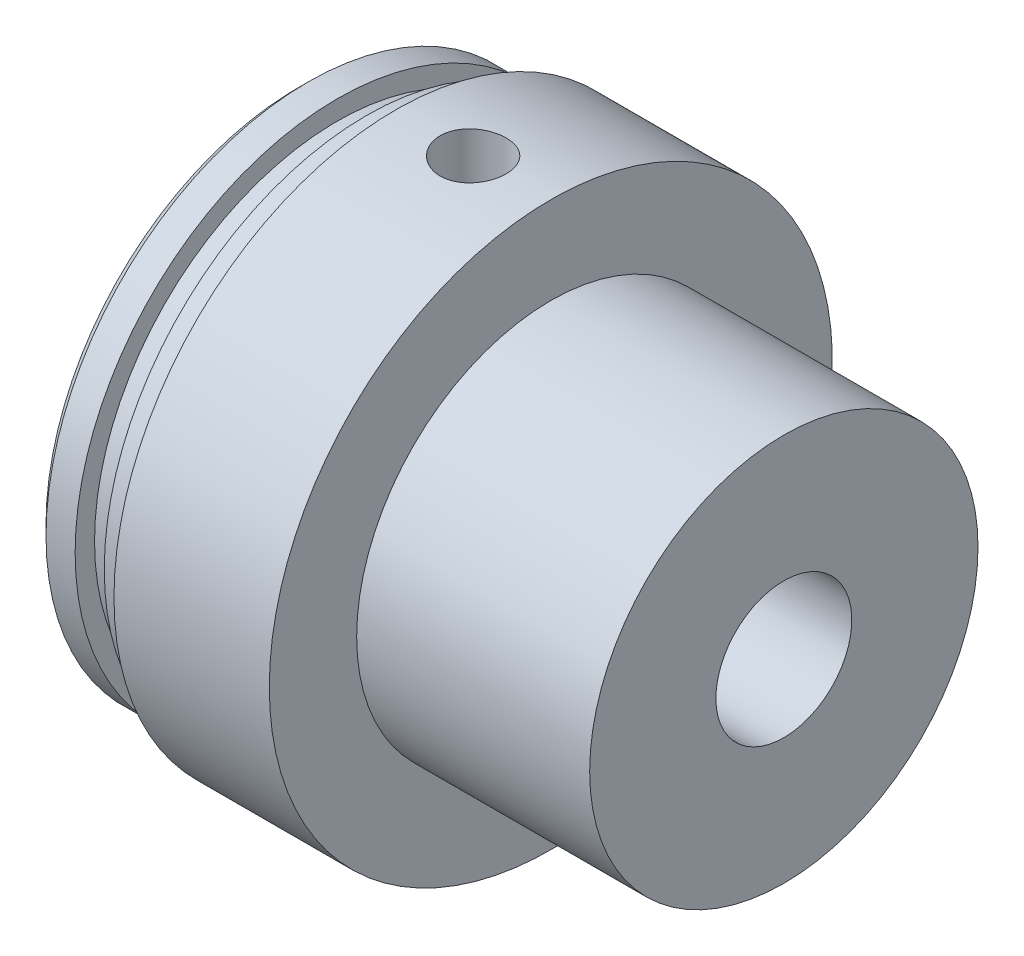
ISO-10303-21;
HEADER;
FILE_DESCRIPTION(('STEP AP214'),'2;1');
FILE_NAME('part.step','',(''),(''),'','','');
FILE_SCHEMA(('AUTOMOTIVE_DESIGN { 1 0 10303 214 1 1 1 1 }'));
ENDSEC;
DATA;
#1=APPLICATION_CONTEXT('core data for automotive mechanical design processes');
#2=APPLICATION_PROTOCOL_DEFINITION('international standard','automotive_design',2000,#1);
#3=PRODUCT_CONTEXT('',#1,'mechanical');
#4=PRODUCT('Part','Part','',(#3));
#5=PRODUCT_RELATED_PRODUCT_CATEGORY('part','',(#4));
#6=PRODUCT_DEFINITION_FORMATION('','',#4);
#7=PRODUCT_DEFINITION_CONTEXT('part definition',#1,'design');
#8=PRODUCT_DEFINITION('design','',#6,#7);
#9=PRODUCT_DEFINITION_SHAPE('','',#8);
#10=(LENGTH_UNIT() NAMED_UNIT(*) SI_UNIT(.MILLI.,.METRE.));
#11=(NAMED_UNIT(*) PLANE_ANGLE_UNIT() SI_UNIT($,.RADIAN.));
#12=(NAMED_UNIT(*) SI_UNIT($,.STERADIAN.) SOLID_ANGLE_UNIT());
#13=UNCERTAINTY_MEASURE_WITH_UNIT(LENGTH_MEASURE(1.E-05),#10,'distance_accuracy_value','');
#14=(GEOMETRIC_REPRESENTATION_CONTEXT(3) GLOBAL_UNCERTAINTY_ASSIGNED_CONTEXT((#13)) GLOBAL_UNIT_ASSIGNED_CONTEXT((#10,
#11,#12)) REPRESENTATION_CONTEXT('',''));
#15=CARTESIAN_POINT('',(0.,0.,0.));
#16=DIRECTION('',(0.,0.,1.));
#17=DIRECTION('',(1.,0.,0.));
#18=AXIS2_PLACEMENT_3D('',#15,#16,#17);
#19=CARTESIAN_POINT('',(-46.0679162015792,0.,0.));
#20=DIRECTION('',(-1.,0.,0.));
#21=DIRECTION('',(0.,0.,1.));
#22=AXIS2_PLACEMENT_3D('',#19,#20,#21);
#23=CYLINDRICAL_SURFACE('',#22,20.);
#24=CARTESIAN_POINT('',(26.,0.,0.));
#25=DIRECTION('',(-1.,0.,0.));
#26=DIRECTION('',(0.,0.,1.));
#27=AXIS2_PLACEMENT_3D('',#24,#25,#26);
#28=CIRCLE('',#27,20.);
#29=CARTESIAN_POINT('',(26.,0.,20.));
#30=VERTEX_POINT('',#29);
#31=EDGE_CURVE('E71',#30,#30,#28,.T.);
#32=CARTESIAN_POINT('',(50.,0.,0.));
#33=DIRECTION('',(-1.,0.,0.));
#34=DIRECTION('',(0.,0.,1.));
#35=AXIS2_PLACEMENT_3D('',#32,#33,#34);
#36=CIRCLE('',#35,20.);
#37=CARTESIAN_POINT('',(50.,0.,20.));
#38=VERTEX_POINT('',#37);
#39=EDGE_CURVE('E101',#38,#38,#36,.T.);
#40=CARTESIAN_POINT('',(26.,0.,20.));
#41=CARTESIAN_POINT('',(26.25,0.,20.));
#42=CARTESIAN_POINT('',(26.5,0.,20.));
#43=CARTESIAN_POINT('',(27.,0.,20.));
#44=CARTESIAN_POINT('',(27.25,0.,20.));
#45=CARTESIAN_POINT('',(27.75,0.,20.));
#46=CARTESIAN_POINT('',(28.,0.,20.));
#47=CARTESIAN_POINT('',(28.5,0.,20.));
#48=CARTESIAN_POINT('',(28.75,0.,20.));
#49=CARTESIAN_POINT('',(29.25,0.,20.));
#50=CARTESIAN_POINT('',(29.5,0.,20.));
#51=CARTESIAN_POINT('',(30.,0.,20.));
#52=CARTESIAN_POINT('',(30.25,0.,20.));
#53=CARTESIAN_POINT('',(30.75,0.,20.));
#54=CARTESIAN_POINT('',(31.,0.,20.));
#55=CARTESIAN_POINT('',(31.5,0.,20.));
#56=CARTESIAN_POINT('',(31.75,0.,20.));
#57=CARTESIAN_POINT('',(32.25,0.,20.));
#58=CARTESIAN_POINT('',(32.5,0.,20.));
#59=CARTESIAN_POINT('',(33.,0.,20.));
#60=CARTESIAN_POINT('',(33.25,0.,20.));
#61=CARTESIAN_POINT('',(33.75,0.,20.));
#62=CARTESIAN_POINT('',(34.,0.,20.));
#63=CARTESIAN_POINT('',(34.5,0.,20.));
#64=CARTESIAN_POINT('',(34.75,0.,20.));
#65=CARTESIAN_POINT('',(35.25,0.,20.));
#66=CARTESIAN_POINT('',(35.5,0.,20.));
#67=CARTESIAN_POINT('',(36.,0.,20.));
#68=CARTESIAN_POINT('',(36.25,0.,20.));
#69=CARTESIAN_POINT('',(36.75,0.,20.));
#70=CARTESIAN_POINT('',(37.,0.,20.));
#71=CARTESIAN_POINT('',(37.5,0.,20.));
#72=CARTESIAN_POINT('',(37.75,0.,20.));
#73=CARTESIAN_POINT('',(38.25,0.,20.));
#74=CARTESIAN_POINT('',(38.5,0.,20.));
#75=CARTESIAN_POINT('',(39.,0.,20.));
#76=CARTESIAN_POINT('',(39.25,0.,20.));
#77=CARTESIAN_POINT('',(39.75,0.,20.));
#78=CARTESIAN_POINT('',(40.,0.,20.));
#79=CARTESIAN_POINT('',(40.5,0.,20.));
#80=CARTESIAN_POINT('',(40.75,0.,20.));
#81=CARTESIAN_POINT('',(41.25,0.,20.));
#82=CARTESIAN_POINT('',(41.5,0.,20.));
#83=CARTESIAN_POINT('',(42.,0.,20.));
#84=CARTESIAN_POINT('',(42.25,0.,20.));
#85=CARTESIAN_POINT('',(42.75,0.,20.));
#86=CARTESIAN_POINT('',(43.,0.,20.));
#87=CARTESIAN_POINT('',(43.5,0.,20.));
#88=CARTESIAN_POINT('',(43.75,0.,20.));
#89=CARTESIAN_POINT('',(44.25,0.,20.));
#90=CARTESIAN_POINT('',(44.5000000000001,0.,20.));
#91=CARTESIAN_POINT('',(45.0000000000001,0.,20.));
#92=CARTESIAN_POINT('',(45.2500000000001,0.,20.));
#93=CARTESIAN_POINT('',(45.7500000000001,0.,20.));
#94=CARTESIAN_POINT('',(46.0000000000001,0.,20.));
#95=CARTESIAN_POINT('',(46.5000000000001,0.,20.));
#96=CARTESIAN_POINT('',(46.7500000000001,0.,20.));
#97=CARTESIAN_POINT('',(47.25,0.,20.));
#98=CARTESIAN_POINT('',(47.5,0.,20.));
#99=CARTESIAN_POINT('',(48.,0.,20.));
#100=CARTESIAN_POINT('',(48.25,0.,20.));
#101=CARTESIAN_POINT('',(48.75,0.,20.));
#102=CARTESIAN_POINT('',(49.,0.,20.));
#103=CARTESIAN_POINT('',(49.5,0.,20.));
#104=CARTESIAN_POINT('',(49.75,0.,20.));
#105=CARTESIAN_POINT('',(50.,0.,20.));
#106=B_SPLINE_CURVE_WITH_KNOTS('',3,(#40,#41,#42,#43,#44,#45,#46,#47,#48,#49,#50,#51,#52,#53,
#54,#55,#56,#57,#58,#59,#60,#61,#62,#63,#64,#65,#66,#67,#68,#69,#70,#71,#72,#73,#74,#75,#76,#77,
#78,#79,#80,#81,#82,#83,#84,#85,#86,#87,#88,#89,#90,#91,#92,#93,#94,#95,#96,#97,#98,#99,#100,
#101,#102,#103,#104,#105),.UNSPECIFIED.,.F.,.F.,(4,2,2,2,2,2,2,2,2,2,2,2,2,2,2,2,2,2,2,2,2,2,2,
2,2,2,2,2,2,2,2,2,4),(0.,0.750000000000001,1.5,2.25,3.,3.75,4.5,5.25,6.00000000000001,
6.75000000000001,7.50000000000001,8.25000000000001,9.00000000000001,9.75000000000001,10.5,11.25,
12.,12.75,13.5,14.25,15.,15.75,16.5,17.25,18.,18.75,19.5,20.25,21.,21.75,22.5,23.25,24.),.UNSPECIFIED.);
#107=EDGE_CURVE('BSEAM36',#30,#38,#106,.T.);
#108=ORIENTED_EDGE('',*,*,#31,.F.);
#109=ORIENTED_EDGE('',*,*,#39,.T.);
#110=ORIENTED_EDGE('',*,*,#107,.T.);
#111=ORIENTED_EDGE('',*,*,#107,.F.);
#112=EDGE_LOOP('',(#108,#110,#109,#111));
#113=FACE_BOUND('',#112,.T.);
#114=ADVANCED_FACE('F36',(#113),#23,.T.);
#115=CARTESIAN_POINT('',(49.9999999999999,20.,0.));
#116=DIRECTION('',(-1.,0.,0.));
#117=DIRECTION('',(0.,0.,1.));
#118=AXIS2_PLACEMENT_3D('',#115,#116,#117);
#119=PLANE('',#118);
#120=ORIENTED_EDGE('',*,*,#39,.F.);
#121=EDGE_LOOP('',(#120));
#122=FACE_BOUND('',#121,.T.);
#123=CARTESIAN_POINT('',(50.,0.,0.));
#124=DIRECTION('',(-1.,0.,0.));
#125=DIRECTION('',(0.,0.,1.));
#126=AXIS2_PLACEMENT_3D('',#123,#124,#125);
#127=CIRCLE('',#126,7.);
#128=CARTESIAN_POINT('',(50.,0.,7.));
#129=VERTEX_POINT('',#128);
#130=EDGE_CURVE('E98',#129,#129,#127,.T.);
#131=ORIENTED_EDGE('',*,*,#130,.T.);
#132=EDGE_LOOP('',(#131));
#133=FACE_BOUND('',#132,.T.);
#134=ADVANCED_FACE('F149',(#122,#133),#119,.F.);
#135=CARTESIAN_POINT('',(-46.0679162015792,0.,0.));
#136=DIRECTION('',(-1.,0.,0.));
#137=DIRECTION('',(0.,0.,1.));
#138=AXIS2_PLACEMENT_3D('',#135,#136,#137);
#139=CYLINDRICAL_SURFACE('',#138,7.);
#140=CARTESIAN_POINT('',(17.9633307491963,6.99973595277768,-0.0607996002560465));
#141=CARTESIAN_POINT('',(17.9598838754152,6.99975371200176,-0.0587550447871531));
#142=CARTESIAN_POINT('',(17.9566066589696,6.99977311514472,-0.0564188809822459));
#143=CARTESIAN_POINT('',(17.9504886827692,6.99981303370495,-0.0512271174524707));
#144=CARTESIAN_POINT('',(17.947648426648,6.99983355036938,-0.0483709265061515));
#145=CARTESIAN_POINT('',(17.9424929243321,6.9998733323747,-0.042222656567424));
#146=CARTESIAN_POINT('',(17.9401771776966,6.99989259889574,-0.0389309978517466));
#147=CARTESIAN_POINT('',(17.9361371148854,6.99992769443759,-0.0320038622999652));
#148=CARTESIAN_POINT('',(17.9344126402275,6.99994352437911,-0.0283684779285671));
#149=CARTESIAN_POINT('',(17.9316175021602,6.99996982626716,-0.0208877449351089));
#150=CARTESIAN_POINT('',(17.9305417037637,6.99998034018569,-0.0170443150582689));
#151=CARTESIAN_POINT('',(17.9290546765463,6.99999500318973,-0.00923086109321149));
#152=CARTESIAN_POINT('',(17.9286434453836,6.99999915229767,-0.00526083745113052));
#153=CARTESIAN_POINT('',(17.9284983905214,7.00000060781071,0.00266903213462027));
#154=CARTESIAN_POINT('',(17.9287607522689,6.99999795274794,0.00662880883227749));
#155=CARTESIAN_POINT('',(17.9299469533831,6.9999861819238,0.0144479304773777));
#156=CARTESIAN_POINT('',(17.930870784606,6.99997706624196,0.0183072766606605));
#157=CARTESIAN_POINT('',(17.9333517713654,6.99995340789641,0.0258143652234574));
#158=CARTESIAN_POINT('',(17.9349085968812,6.99993886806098,0.0294622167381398));
#159=CARTESIAN_POINT('',(17.9386097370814,6.999905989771,0.0364464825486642));
#160=CARTESIAN_POINT('',(17.9407540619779,6.99988765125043,0.039782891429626));
#161=CARTESIAN_POINT('',(17.9455795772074,6.99984912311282,0.0460672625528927));
#162=CARTESIAN_POINT('',(17.9482632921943,6.99982892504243,0.0490132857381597));
#163=CARTESIAN_POINT('',(17.9540837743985,6.99978900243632,0.0544172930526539));
#164=CARTESIAN_POINT('',(17.9572205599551,6.99976927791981,0.0568752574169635));
#165=CARTESIAN_POINT('',(17.9638845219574,6.99973233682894,0.0612540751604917));
#166=CARTESIAN_POINT('',(17.9674145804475,6.99971514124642,0.0631705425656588));
#167=CARTESIAN_POINT('',(17.9747446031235,6.99968536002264,0.0663887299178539));
#168=CARTESIAN_POINT('',(17.9785445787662,6.9996727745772,0.0676904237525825));
#169=CARTESIAN_POINT('',(17.9863371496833,6.99965353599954,0.0696516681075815));
#170=CARTESIAN_POINT('',(17.9903309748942,6.9996469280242,0.0703063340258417));
#171=CARTESIAN_POINT('',(17.9983719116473,6.99964054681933,0.0709388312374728));
#172=CARTESIAN_POINT('',(18.002419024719,6.99964077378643,0.0709166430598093));
#173=CARTESIAN_POINT('',(18.0104685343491,6.99964805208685,0.070194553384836));
#174=CARTESIAN_POINT('',(18.0144706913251,6.99965513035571,0.0694919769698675));
#175=CARTESIAN_POINT('',(18.0223000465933,6.99967535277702,0.0674241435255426));
#176=CARTESIAN_POINT('',(18.0261272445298,6.9996884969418,0.0660588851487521));
#177=CARTESIAN_POINT('',(18.033492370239,6.99971934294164,0.0627049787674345));
#178=CARTESIAN_POINT('',(18.0370306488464,6.9997370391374,0.0607171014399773));
#179=CARTESIAN_POINT('',(18.0437206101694,6.99977498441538,0.0561721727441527));
#180=CARTESIAN_POINT('',(18.0468723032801,6.99979523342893,0.0536151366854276));
#181=CARTESIAN_POINT('',(18.0526790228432,6.99983584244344,0.0480201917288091));
#182=CARTESIAN_POINT('',(18.0553368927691,6.99985620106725,0.0449852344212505));
#183=CARTESIAN_POINT('',(18.0601003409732,6.99989482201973,0.0385090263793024));
#184=CARTESIAN_POINT('',(18.0622059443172,6.99991308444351,0.0350677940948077));
#185=CARTESIAN_POINT('',(18.0657868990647,6.99994527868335,0.0279069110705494));
#186=CARTESIAN_POINT('',(18.0672672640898,6.99995924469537,0.0241897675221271));
#187=CARTESIAN_POINT('',(18.0695781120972,6.99998145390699,0.01655867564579));
#188=CARTESIAN_POINT('',(18.0704086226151,6.99998969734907,0.0126447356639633));
#189=CARTESIAN_POINT('',(18.0713913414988,6.99999948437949,0.00475963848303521));
#190=CARTESIAN_POINT('',(18.071548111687,7.00000107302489,0.000789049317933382));
#191=CARTESIAN_POINT('',(18.0711911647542,6.99999749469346,-0.00712181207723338));
#192=CARTESIAN_POINT('',(18.070677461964,6.99999232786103,-0.011062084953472));
#193=CARTESIAN_POINT('',(18.0689968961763,6.99997584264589,-0.0187913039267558));
#194=CARTESIAN_POINT('',(18.0678315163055,6.99996453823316,-0.0225805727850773));
#195=CARTESIAN_POINT('',(18.0648831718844,6.99993705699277,-0.0299106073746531));
#196=CARTESIAN_POINT('',(18.0631001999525,6.99992088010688,-0.0334513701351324));
#197=CARTESIAN_POINT('',(18.0589620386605,6.99988540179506,-0.0401969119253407));
#198=CARTESIAN_POINT('',(18.0566049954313,6.99986609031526,-0.0434005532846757));
#199=CARTESIAN_POINT('',(18.0513900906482,6.99982653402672,-0.0493702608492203));
#200=CARTESIAN_POINT('',(18.048532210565,6.99980628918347,-0.0521363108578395));
#201=CARTESIAN_POINT('',(18.0423747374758,6.99976696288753,-0.0571740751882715));
#202=CARTESIAN_POINT('',(18.0390720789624,6.99974789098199,-0.0594420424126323));
#203=CARTESIAN_POINT('',(18.0321354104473,6.99971319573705,-0.0633963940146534));
#204=CARTESIAN_POINT('',(18.0285013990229,6.99969757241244,-0.0650827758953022));
#205=CARTESIAN_POINT('',(18.0209742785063,6.99967139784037,-0.0678398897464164));
#206=CARTESIAN_POINT('',(18.0170793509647,6.99966088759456,-0.0689056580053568));
#207=CARTESIAN_POINT('',(18.0091651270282,6.99964629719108,-0.0703722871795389));
#208=CARTESIAN_POINT('',(18.005145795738,6.99964221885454,-0.0707729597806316));
#209=CARTESIAN_POINT('',(17.9970735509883,6.99964094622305,-0.0708987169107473));
#210=CARTESIAN_POINT('',(17.9930205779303,6.99964379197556,-0.0706198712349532));
#211=CARTESIAN_POINT('',(17.9850223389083,6.99965613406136,-0.0693857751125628));
#212=CARTESIAN_POINT('',(17.9810769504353,6.99966562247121,-0.0684313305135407));
#213=CARTESIAN_POINT('',(17.9748187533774,6.9996856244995,-0.0663459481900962));
#214=CARTESIAN_POINT('',(17.9724394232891,6.99969447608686,-0.0654091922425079));
#215=CARTESIAN_POINT('',(17.9677939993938,6.9997139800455,-0.0632876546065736));
#216=CARTESIAN_POINT('',(17.9655279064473,6.99972463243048,-0.0621028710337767));
#217=CARTESIAN_POINT('',(17.9633307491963,6.99973595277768,-0.0607996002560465));
#218=B_SPLINE_CURVE_WITH_KNOTS('',3,(#140,#141,#142,#143,#144,#145,#146,#147,#148,#149,#150,
#151,#152,#153,#154,#155,#156,#157,#158,#159,#160,#161,#162,#163,#164,#165,#166,#167,#168,#169,
#170,#171,#172,#173,#174,#175,#176,#177,#178,#179,#180,#181,#182,#183,#184,#185,#186,#187,#188,
#189,#190,#191,#192,#193,#194,#195,#196,#197,#198,#199,#200,#201,#202,#203,#204,#205,#206,#207,
#208,#209,#210,#211,#212,#213,#214,#215,#216,#217),.UNSPECIFIED.,.T.,.F.,(4,2,2,2,2,2,2,2,2,2,2,
2,2,2,2,2,2,2,2,2,2,2,2,2,2,2,2,2,2,2,2,2,2,2,2,2,2,2,4),(0.,0.0120137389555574,
0.024041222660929,0.0360571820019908,0.0480699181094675,0.0599862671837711,0.0719025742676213,
0.08375154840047,0.0956003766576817,0.107443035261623,0.119285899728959,0.131185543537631,
0.143085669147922,0.155079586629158,0.167074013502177,0.179158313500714,0.191242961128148,
0.2033753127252,0.215507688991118,0.227625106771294,0.239742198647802,0.251787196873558,
0.263831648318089,0.275777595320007,0.287723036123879,0.299587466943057,0.311451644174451,
0.32328892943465,0.33512635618,0.347002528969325,0.358879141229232,0.370842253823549,
0.382805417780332,0.394862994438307,0.406923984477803,0.419054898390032,0.431171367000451,
0.438829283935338,0.446487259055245),.UNSPECIFIED.);
#219=CARTESIAN_POINT('',(17.9633307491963,6.99973595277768,-0.0607996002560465));
#220=VERTEX_POINT('',#219);
#221=EDGE_CURVE('E70',#220,#220,#218,.T.);
#222=ORIENTED_EDGE('',*,*,#221,.T.);
#223=EDGE_LOOP('',(#222));
#224=FACE_BOUND('',#223,.T.);
#225=ORIENTED_EDGE('',*,*,#130,.F.);
#226=EDGE_LOOP('',(#225));
#227=FACE_BOUND('',#226,.T.);
#228=CARTESIAN_POINT('',(0.,0.,0.));
#229=DIRECTION('',(-1.,0.,0.));
#230=DIRECTION('',(0.,0.,1.));
#231=AXIS2_PLACEMENT_3D('',#228,#229,#230);
#232=CIRCLE('',#231,7.);
#233=CARTESIAN_POINT('',(0.,0.,7.));
#234=VERTEX_POINT('',#233);
#235=EDGE_CURVE('E95',#234,#234,#232,.T.);
#236=ORIENTED_EDGE('',*,*,#235,.T.);
#237=EDGE_LOOP('',(#236));
#238=FACE_BOUND('',#237,.T.);
#239=ADVANCED_FACE('F117',(#224,#227,#238),#139,.F.);
#240=CARTESIAN_POINT('',(0.,6.99999999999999,0.));
#241=DIRECTION('',(1.,0.,0.));
#242=DIRECTION('',(0.,0.,-1.));
#243=AXIS2_PLACEMENT_3D('',#240,#241,#242);
#244=PLANE('',#243);
#245=CARTESIAN_POINT('',(-1.11022302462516E-13,12.,0.));
#246=DIRECTION('',(-1.,0.,0.));
#247=DIRECTION('',(0.,0.,1.));
#248=AXIS2_PLACEMENT_3D('',#245,#246,#247);
#249=CIRCLE('',#248,2.74999999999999);
#250=CARTESIAN_POINT('',(-1.11022302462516E-13,12.,2.74999999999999));
#251=VERTEX_POINT('',#250);
#252=EDGE_CURVE('E61',#251,#251,#249,.T.);
#253=ORIENTED_EDGE('',*,*,#252,.F.);
#254=EDGE_LOOP('',(#253));
#255=FACE_BOUND('',#254,.T.);
#256=CARTESIAN_POINT('',(0.,0.,0.));
#257=DIRECTION('',(1.,0.,0.));
#258=DIRECTION('',(0.,0.,-1.));
#259=AXIS2_PLACEMENT_3D('',#256,#257,#258);
#260=CIRCLE('',#259,26.);
#261=CARTESIAN_POINT('',(0.,0.,-26.));
#262=VERTEX_POINT('',#261);
#263=EDGE_CURVE('E104',#262,#262,#260,.F.);
#264=ORIENTED_EDGE('',*,*,#263,.T.);
#265=EDGE_LOOP('',(#264));
#266=FACE_BOUND('',#265,.T.);
#267=ORIENTED_EDGE('',*,*,#235,.F.);
#268=EDGE_LOOP('',(#267));
#269=FACE_BOUND('',#268,.T.);
#270=ADVANCED_FACE('F163',(#255,#266,#269),#244,.F.);
#271=CARTESIAN_POINT('',(-46.0679162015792,0.,0.));
#272=DIRECTION('',(-1.,0.,0.));
#273=DIRECTION('',(0.,0.,1.));
#274=AXIS2_PLACEMENT_3D('',#271,#272,#273);
#275=CYLINDRICAL_SURFACE('',#274,27.);
#276=CARTESIAN_POINT('',(1.,0.,0.));
#277=DIRECTION('',(1.,0.,0.));
#278=DIRECTION('',(0.,0.,-1.));
#279=AXIS2_PLACEMENT_3D('',#276,#277,#278);
#280=CIRCLE('',#279,27.);
#281=CARTESIAN_POINT('',(1.,0.,27.));
#282=VERTEX_POINT('',#281);
#283=EDGE_CURVE('E48',#282,#282,#280,.T.);
#284=CARTESIAN_POINT('',(4.,0.,0.));
#285=DIRECTION('',(-1.,0.,0.));
#286=DIRECTION('',(0.,0.,1.));
#287=AXIS2_PLACEMENT_3D('',#284,#285,#286);
#288=CIRCLE('',#287,27.);
#289=CARTESIAN_POINT('',(4.,0.,27.));
#290=VERTEX_POINT('',#289);
#291=EDGE_CURVE('E92',#290,#290,#288,.T.);
#292=CARTESIAN_POINT('',(1.,0.,27.));
#293=CARTESIAN_POINT('',(1.03125,0.,27.));
#294=CARTESIAN_POINT('',(1.0625,0.,27.));
#295=CARTESIAN_POINT('',(1.125,0.,27.));
#296=CARTESIAN_POINT('',(1.15625,0.,27.));
#297=CARTESIAN_POINT('',(1.21875,0.,27.));
#298=CARTESIAN_POINT('',(1.25,0.,27.));
#299=CARTESIAN_POINT('',(1.3125,0.,27.));
#300=CARTESIAN_POINT('',(1.34375,0.,27.));
#301=CARTESIAN_POINT('',(1.40625,0.,27.));
#302=CARTESIAN_POINT('',(1.4375,0.,27.));
#303=CARTESIAN_POINT('',(1.5,0.,27.));
#304=CARTESIAN_POINT('',(1.53125,0.,27.));
#305=CARTESIAN_POINT('',(1.59375,0.,27.));
#306=CARTESIAN_POINT('',(1.625,0.,27.));
#307=CARTESIAN_POINT('',(1.6875,0.,27.));
#308=CARTESIAN_POINT('',(1.71875,0.,27.));
#309=CARTESIAN_POINT('',(1.78125,0.,27.));
#310=CARTESIAN_POINT('',(1.8125,0.,27.));
#311=CARTESIAN_POINT('',(1.875,0.,27.));
#312=CARTESIAN_POINT('',(1.90625,0.,27.));
#313=CARTESIAN_POINT('',(1.96875,0.,27.));
#314=CARTESIAN_POINT('',(2.,0.,27.));
#315=CARTESIAN_POINT('',(2.0625,0.,27.));
#316=CARTESIAN_POINT('',(2.09375,0.,27.));
#317=CARTESIAN_POINT('',(2.15625,0.,27.));
#318=CARTESIAN_POINT('',(2.1875,0.,27.));
#319=CARTESIAN_POINT('',(2.25,0.,27.));
#320=CARTESIAN_POINT('',(2.28125,0.,27.));
#321=CARTESIAN_POINT('',(2.34375,0.,27.));
#322=CARTESIAN_POINT('',(2.375,0.,27.));
#323=CARTESIAN_POINT('',(2.4375,0.,27.));
#324=CARTESIAN_POINT('',(2.46875,0.,27.));
#325=CARTESIAN_POINT('',(2.53125,0.,27.));
#326=CARTESIAN_POINT('',(2.5625,0.,27.));
#327=CARTESIAN_POINT('',(2.625,0.,27.));
#328=CARTESIAN_POINT('',(2.65625,0.,27.));
#329=CARTESIAN_POINT('',(2.71875,0.,27.));
#330=CARTESIAN_POINT('',(2.75,0.,27.));
#331=CARTESIAN_POINT('',(2.8125,0.,27.));
#332=CARTESIAN_POINT('',(2.84375,0.,27.));
#333=CARTESIAN_POINT('',(2.90625,0.,27.));
#334=CARTESIAN_POINT('',(2.9375,0.,27.));
#335=CARTESIAN_POINT('',(3.,0.,27.));
#336=CARTESIAN_POINT('',(3.03125,0.,27.));
#337=CARTESIAN_POINT('',(3.09375,0.,27.));
#338=CARTESIAN_POINT('',(3.125,0.,27.));
#339=CARTESIAN_POINT('',(3.1875,0.,27.));
#340=CARTESIAN_POINT('',(3.21875,0.,27.));
#341=CARTESIAN_POINT('',(3.28125,0.,27.));
#342=CARTESIAN_POINT('',(3.31250000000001,0.,27.));
#343=CARTESIAN_POINT('',(3.37500000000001,0.,27.));
#344=CARTESIAN_POINT('',(3.40625,0.,27.));
#345=CARTESIAN_POINT('',(3.46875,0.,27.));
#346=CARTESIAN_POINT('',(3.5,0.,27.));
#347=CARTESIAN_POINT('',(3.5625,0.,27.));
#348=CARTESIAN_POINT('',(3.59375,0.,27.));
#349=CARTESIAN_POINT('',(3.65625,0.,27.));
#350=CARTESIAN_POINT('',(3.68750000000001,0.,27.));
#351=CARTESIAN_POINT('',(3.75000000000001,0.,27.));
#352=CARTESIAN_POINT('',(3.78125,0.,27.));
#353=CARTESIAN_POINT('',(3.84375,0.,27.));
#354=CARTESIAN_POINT('',(3.875,0.,27.));
#355=CARTESIAN_POINT('',(3.9375,0.,27.));
#356=CARTESIAN_POINT('',(3.96875,0.,27.));
#357=CARTESIAN_POINT('',(4.,0.,27.));
#358=B_SPLINE_CURVE_WITH_KNOTS('',3,(#292,#293,#294,#295,#296,#297,#298,#299,#300,#301,#302,
#303,#304,#305,#306,#307,#308,#309,#310,#311,#312,#313,#314,#315,#316,#317,#318,#319,#320,#321,
#322,#323,#324,#325,#326,#327,#328,#329,#330,#331,#332,#333,#334,#335,#336,#337,#338,#339,#340,
#341,#342,#343,#344,#345,#346,#347,#348,#349,#350,#351,#352,#353,#354,#355,#356,#357),
.UNSPECIFIED.,.F.,.F.,(4,2,2,2,2,2,2,2,2,2,2,2,2,2,2,2,2,2,2,2,2,2,2,2,2,2,2,2,2,2,2,2,4),(0.,
0.0937500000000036,0.1875,0.281249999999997,0.375,0.468750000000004,0.5625,0.656249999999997,
0.750000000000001,0.843750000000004,0.937500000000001,1.03125,1.125,1.21875,1.3125,1.40625,1.5,
1.59375,1.6875,1.78125,1.875,1.96875000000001,2.0625,2.15625,2.25,2.34375000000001,2.4375,
2.53125,2.625,2.71875000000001,2.8125,2.90625,3.),.UNSPECIFIED.);
#359=EDGE_CURVE('BSEAM168',#282,#290,#358,.T.);
#360=ORIENTED_EDGE('',*,*,#283,.T.);
#361=ORIENTED_EDGE('',*,*,#291,.T.);
#362=ORIENTED_EDGE('',*,*,#359,.T.);
#363=ORIENTED_EDGE('',*,*,#359,.F.);
#364=EDGE_LOOP('',(#360,#362,#361,#363));
#365=FACE_BOUND('',#364,.T.);
#366=ADVANCED_FACE('F168',(#365),#275,.T.);
#367=CARTESIAN_POINT('',(4.,27.,0.));
#368=DIRECTION('',(-1.,0.,0.));
#369=DIRECTION('',(0.,0.,1.));
#370=AXIS2_PLACEMENT_3D('',#367,#368,#369);
#371=PLANE('',#370);
#372=ORIENTED_EDGE('',*,*,#291,.F.);
#373=EDGE_LOOP('',(#372));
#374=FACE_BOUND('',#373,.T.);
#375=CARTESIAN_POINT('',(4.,0.,0.));
#376=DIRECTION('',(-1.,0.,0.));
#377=DIRECTION('',(0.,0.,1.));
#378=AXIS2_PLACEMENT_3D('',#375,#376,#377);
#379=CIRCLE('',#378,25.);
#380=CARTESIAN_POINT('',(4.,0.,25.));
#381=VERTEX_POINT('',#380);
#382=EDGE_CURVE('E89',#381,#381,#379,.T.);
#383=ORIENTED_EDGE('',*,*,#382,.T.);
#384=EDGE_LOOP('',(#383));
#385=FACE_BOUND('',#384,.T.);
#386=ADVANCED_FACE('F173',(#374,#385),#371,.F.);
#387=CARTESIAN_POINT('',(-46.0679162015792,0.,0.));
#388=DIRECTION('',(-1.,0.,0.));
#389=DIRECTION('',(0.,0.,1.));
#390=AXIS2_PLACEMENT_3D('',#387,#388,#389);
#391=CYLINDRICAL_SURFACE('',#390,25.);
#392=CARTESIAN_POINT('',(7.00000000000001,0.,0.));
#393=DIRECTION('',(-1.,0.,0.));
#394=DIRECTION('',(0.,0.,1.));
#395=AXIS2_PLACEMENT_3D('',#392,#393,#394);
#396=CIRCLE('',#395,25.);
#397=CARTESIAN_POINT('',(7.00000000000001,0.,25.));
#398=VERTEX_POINT('',#397);
#399=EDGE_CURVE('E86',#398,#398,#396,.T.);
#400=CARTESIAN_POINT('',(4.,0.,25.));
#401=CARTESIAN_POINT('',(4.03125,0.,25.));
#402=CARTESIAN_POINT('',(4.06250000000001,0.,25.));
#403=CARTESIAN_POINT('',(4.12500000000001,0.,25.));
#404=CARTESIAN_POINT('',(4.15625,0.,25.));
#405=CARTESIAN_POINT('',(4.21875,0.,25.));
#406=CARTESIAN_POINT('',(4.25,0.,25.));
#407=CARTESIAN_POINT('',(4.3125,0.,25.));
#408=CARTESIAN_POINT('',(4.34375,0.,25.));
#409=CARTESIAN_POINT('',(4.40625,0.,25.));
#410=CARTESIAN_POINT('',(4.43750000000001,0.,25.));
#411=CARTESIAN_POINT('',(4.50000000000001,0.,25.));
#412=CARTESIAN_POINT('',(4.53125000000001,0.,25.));
#413=CARTESIAN_POINT('',(4.59375,0.,25.));
#414=CARTESIAN_POINT('',(4.625,0.,25.));
#415=CARTESIAN_POINT('',(4.6875,0.,25.));
#416=CARTESIAN_POINT('',(4.71875,0.,25.));
#417=CARTESIAN_POINT('',(4.78125000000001,0.,25.));
#418=CARTESIAN_POINT('',(4.81250000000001,0.,25.));
#419=CARTESIAN_POINT('',(4.87500000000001,0.,25.));
#420=CARTESIAN_POINT('',(4.90625000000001,0.,25.));
#421=CARTESIAN_POINT('',(4.96875,0.,25.));
#422=CARTESIAN_POINT('',(5.,0.,25.));
#423=CARTESIAN_POINT('',(5.0625,0.,25.));
#424=CARTESIAN_POINT('',(5.09375,0.,25.));
#425=CARTESIAN_POINT('',(5.15625000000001,0.,25.));
#426=CARTESIAN_POINT('',(5.18750000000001,0.,25.));
#427=CARTESIAN_POINT('',(5.25000000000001,0.,25.));
#428=CARTESIAN_POINT('',(5.28125000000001,0.,25.));
#429=CARTESIAN_POINT('',(5.34375,0.,25.));
#430=CARTESIAN_POINT('',(5.375,0.,25.));
#431=CARTESIAN_POINT('',(5.4375,0.,25.));
#432=CARTESIAN_POINT('',(5.46875,0.,25.));
#433=CARTESIAN_POINT('',(5.53125000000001,0.,25.));
#434=CARTESIAN_POINT('',(5.56250000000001,0.,25.));
#435=CARTESIAN_POINT('',(5.62500000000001,0.,25.));
#436=CARTESIAN_POINT('',(5.65625000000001,0.,25.));
#437=CARTESIAN_POINT('',(5.71875,0.,25.));
#438=CARTESIAN_POINT('',(5.75,0.,25.));
#439=CARTESIAN_POINT('',(5.8125,0.,25.));
#440=CARTESIAN_POINT('',(5.84375,0.,25.));
#441=CARTESIAN_POINT('',(5.90625000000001,0.,25.));
#442=CARTESIAN_POINT('',(5.93750000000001,0.,25.));
#443=CARTESIAN_POINT('',(6.00000000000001,0.,25.));
#444=CARTESIAN_POINT('',(6.03125000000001,0.,25.));
#445=CARTESIAN_POINT('',(6.09375,0.,25.));
#446=CARTESIAN_POINT('',(6.125,0.,25.));
#447=CARTESIAN_POINT('',(6.1875,0.,25.));
#448=CARTESIAN_POINT('',(6.21875,0.,25.));
#449=CARTESIAN_POINT('',(6.28125000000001,0.,25.));
#450=CARTESIAN_POINT('',(6.31250000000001,0.,25.));
#451=CARTESIAN_POINT('',(6.37500000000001,0.,25.));
#452=CARTESIAN_POINT('',(6.40625000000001,0.,25.));
#453=CARTESIAN_POINT('',(6.46875,0.,25.));
#454=CARTESIAN_POINT('',(6.5,0.,25.));
#455=CARTESIAN_POINT('',(6.5625,0.,25.));
#456=CARTESIAN_POINT('',(6.59375000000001,0.,25.));
#457=CARTESIAN_POINT('',(6.65625000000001,0.,25.));
#458=CARTESIAN_POINT('',(6.68750000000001,0.,25.));
#459=CARTESIAN_POINT('',(6.75000000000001,0.,25.));
#460=CARTESIAN_POINT('',(6.78125000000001,0.,25.));
#461=CARTESIAN_POINT('',(6.84375000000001,0.,25.));
#462=CARTESIAN_POINT('',(6.875,0.,25.));
#463=CARTESIAN_POINT('',(6.9375,0.,25.));
#464=CARTESIAN_POINT('',(6.96875000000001,0.,25.));
#465=CARTESIAN_POINT('',(7.00000000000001,0.,25.));
#466=B_SPLINE_CURVE_WITH_KNOTS('',3,(#400,#401,#402,#403,#404,#405,#406,#407,#408,#409,#410,
#411,#412,#413,#414,#415,#416,#417,#418,#419,#420,#421,#422,#423,#424,#425,#426,#427,#428,#429,
#430,#431,#432,#433,#434,#435,#436,#437,#438,#439,#440,#441,#442,#443,#444,#445,#446,#447,#448,
#449,#450,#451,#452,#453,#454,#455,#456,#457,#458,#459,#460,#461,#462,#463,#464,#465),
.UNSPECIFIED.,.F.,.F.,(4,2,2,2,2,2,2,2,2,2,2,2,2,2,2,2,2,2,2,2,2,2,2,2,2,2,2,2,2,2,2,2,4),(0.,
0.0937500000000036,0.1875,0.281249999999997,0.375,0.468750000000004,0.5625,0.656249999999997,
0.750000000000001,0.843750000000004,0.937500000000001,1.03125,1.125,1.21875,1.3125,1.40625,1.5,
1.59375,1.6875,1.78125,1.875,1.96875000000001,2.0625,2.15625,2.25,2.34375000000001,2.4375,
2.53125,2.625,2.71875000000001,2.8125,2.90625,3.),.UNSPECIFIED.);
#467=EDGE_CURVE('BSEAM181',#381,#398,#466,.T.);
#468=ORIENTED_EDGE('',*,*,#382,.F.);
#469=ORIENTED_EDGE('',*,*,#399,.T.);
#470=ORIENTED_EDGE('',*,*,#467,.T.);
#471=ORIENTED_EDGE('',*,*,#467,.F.);
#472=EDGE_LOOP('',(#468,#470,#469,#471));
#473=FACE_BOUND('',#472,.T.);
#474=ADVANCED_FACE('F181',(#473),#391,.T.);
#475=CARTESIAN_POINT('',(7.00000000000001,25.,0.));
#476=DIRECTION('',(1.,0.,0.));
#477=DIRECTION('',(0.,0.,-1.));
#478=AXIS2_PLACEMENT_3D('',#475,#476,#477);
#479=PLANE('',#478);
#480=ORIENTED_EDGE('',*,*,#399,.F.);
#481=EDGE_LOOP('',(#480));
#482=FACE_BOUND('',#481,.T.);
#483=CARTESIAN_POINT('',(7.00000000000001,0.,0.));
#484=DIRECTION('',(-1.,0.,0.));
#485=DIRECTION('',(0.,0.,1.));
#486=AXIS2_PLACEMENT_3D('',#483,#484,#485);
#487=CIRCLE('',#486,27.);
#488=CARTESIAN_POINT('',(7.00000000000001,0.,27.));
#489=VERTEX_POINT('',#488);
#490=EDGE_CURVE('E83',#489,#489,#487,.T.);
#491=ORIENTED_EDGE('',*,*,#490,.T.);
#492=EDGE_LOOP('',(#491));
#493=FACE_BOUND('',#492,.T.);
#494=ADVANCED_FACE('F185',(#482,#493),#479,.F.);
#495=CARTESIAN_POINT('',(-46.0679162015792,0.,0.));
#496=DIRECTION('',(-1.,0.,0.));
#497=DIRECTION('',(0.,0.,1.));
#498=AXIS2_PLACEMENT_3D('',#495,#496,#497);
#499=CYLINDRICAL_SURFACE('',#498,27.);
#500=CARTESIAN_POINT('',(10.,0.,0.));
#501=DIRECTION('',(-1.,0.,0.));
#502=DIRECTION('',(0.,0.,1.));
#503=AXIS2_PLACEMENT_3D('',#500,#501,#502);
#504=CIRCLE('',#503,27.);
#505=CARTESIAN_POINT('',(10.,0.,27.));
#506=VERTEX_POINT('',#505);
#507=EDGE_CURVE('E80',#506,#506,#504,.T.);
#508=CARTESIAN_POINT('',(7.00000000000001,0.,27.));
#509=CARTESIAN_POINT('',(7.03125000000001,0.,27.));
#510=CARTESIAN_POINT('',(7.06250000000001,0.,27.));
#511=CARTESIAN_POINT('',(7.12500000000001,0.,27.));
#512=CARTESIAN_POINT('',(7.15625000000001,0.,27.));
#513=CARTESIAN_POINT('',(7.21875000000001,0.,27.));
#514=CARTESIAN_POINT('',(7.25,0.,27.));
#515=CARTESIAN_POINT('',(7.3125,0.,27.));
#516=CARTESIAN_POINT('',(7.34375000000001,0.,27.));
#517=CARTESIAN_POINT('',(7.40625000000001,0.,27.));
#518=CARTESIAN_POINT('',(7.43750000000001,0.,27.));
#519=CARTESIAN_POINT('',(7.50000000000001,0.,27.));
#520=CARTESIAN_POINT('',(7.53125000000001,0.,27.));
#521=CARTESIAN_POINT('',(7.59375000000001,0.,27.));
#522=CARTESIAN_POINT('',(7.625,0.,27.));
#523=CARTESIAN_POINT('',(7.6875,0.,27.));
#524=CARTESIAN_POINT('',(7.71875000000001,0.,27.));
#525=CARTESIAN_POINT('',(7.78125000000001,0.,27.));
#526=CARTESIAN_POINT('',(7.81250000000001,0.,27.));
#527=CARTESIAN_POINT('',(7.87500000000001,0.,27.));
#528=CARTESIAN_POINT('',(7.90625000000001,0.,27.));
#529=CARTESIAN_POINT('',(7.96875000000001,0.,27.));
#530=CARTESIAN_POINT('',(8.00000000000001,0.,27.));
#531=CARTESIAN_POINT('',(8.06250000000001,0.,27.));
#532=CARTESIAN_POINT('',(8.09375000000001,0.,27.));
#533=CARTESIAN_POINT('',(8.15625000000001,0.,27.));
#534=CARTESIAN_POINT('',(8.18750000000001,0.,27.));
#535=CARTESIAN_POINT('',(8.25000000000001,0.,27.));
#536=CARTESIAN_POINT('',(8.28125000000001,0.,27.));
#537=CARTESIAN_POINT('',(8.34375000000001,0.,27.));
#538=CARTESIAN_POINT('',(8.37500000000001,0.,27.));
#539=CARTESIAN_POINT('',(8.43750000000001,0.,27.));
#540=CARTESIAN_POINT('',(8.46875000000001,0.,27.));
#541=CARTESIAN_POINT('',(8.53125000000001,0.,27.));
#542=CARTESIAN_POINT('',(8.56250000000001,0.,27.));
#543=CARTESIAN_POINT('',(8.62500000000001,0.,27.));
#544=CARTESIAN_POINT('',(8.65625000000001,0.,27.));
#545=CARTESIAN_POINT('',(8.71875000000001,0.,27.));
#546=CARTESIAN_POINT('',(8.75000000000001,0.,27.));
#547=CARTESIAN_POINT('',(8.81250000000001,0.,27.));
#548=CARTESIAN_POINT('',(8.84375000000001,0.,27.));
#549=CARTESIAN_POINT('',(8.90625000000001,0.,27.));
#550=CARTESIAN_POINT('',(8.93750000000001,0.,27.));
#551=CARTESIAN_POINT('',(9.00000000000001,0.,27.));
#552=CARTESIAN_POINT('',(9.03125000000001,0.,27.));
#553=CARTESIAN_POINT('',(9.09375000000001,0.,27.));
#554=CARTESIAN_POINT('',(9.12500000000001,0.,27.));
#555=CARTESIAN_POINT('',(9.18750000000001,0.,27.));
#556=CARTESIAN_POINT('',(9.21875000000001,0.,27.));
#557=CARTESIAN_POINT('',(9.28125000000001,0.,27.));
#558=CARTESIAN_POINT('',(9.31250000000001,0.,27.));
#559=CARTESIAN_POINT('',(9.37500000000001,0.,27.));
#560=CARTESIAN_POINT('',(9.40625000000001,0.,27.));
#561=CARTESIAN_POINT('',(9.46875000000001,0.,27.));
#562=CARTESIAN_POINT('',(9.50000000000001,0.,27.));
#563=CARTESIAN_POINT('',(9.56250000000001,0.,27.));
#564=CARTESIAN_POINT('',(9.59375000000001,0.,27.));
#565=CARTESIAN_POINT('',(9.65625000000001,0.,27.));
#566=CARTESIAN_POINT('',(9.68750000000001,0.,27.));
#567=CARTESIAN_POINT('',(9.75000000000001,0.,27.));
#568=CARTESIAN_POINT('',(9.78125000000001,0.,27.));
#569=CARTESIAN_POINT('',(9.84375000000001,0.,27.));
#570=CARTESIAN_POINT('',(9.87500000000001,0.,27.));
#571=CARTESIAN_POINT('',(9.93750000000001,0.,27.));
#572=CARTESIAN_POINT('',(9.96875000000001,0.,27.));
#573=CARTESIAN_POINT('',(10.,0.,27.));
#574=B_SPLINE_CURVE_WITH_KNOTS('',3,(#508,#509,#510,#511,#512,#513,#514,#515,#516,#517,#518,
#519,#520,#521,#522,#523,#524,#525,#526,#527,#528,#529,#530,#531,#532,#533,#534,#535,#536,#537,
#538,#539,#540,#541,#542,#543,#544,#545,#546,#547,#548,#549,#550,#551,#552,#553,#554,#555,#556,
#557,#558,#559,#560,#561,#562,#563,#564,#565,#566,#567,#568,#569,#570,#571,#572,#573),
.UNSPECIFIED.,.F.,.F.,(4,2,2,2,2,2,2,2,2,2,2,2,2,2,2,2,2,2,2,2,2,2,2,2,2,2,2,2,2,2,2,2,4),(0.,
0.0937500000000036,0.1875,0.281249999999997,0.375,0.468750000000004,0.5625,0.656249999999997,
0.750000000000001,0.843750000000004,0.937500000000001,1.03125,1.125,1.21875,1.3125,1.40625,1.5,
1.59375,1.6875,1.78125,1.875,1.96875000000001,2.0625,2.15625,2.25,2.34375000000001,2.4375,
2.53125,2.625,2.71875000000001,2.8125,2.90625,3.),.UNSPECIFIED.);
#575=EDGE_CURVE('BSEAM189',#489,#506,#574,.T.);
#576=ORIENTED_EDGE('',*,*,#490,.F.);
#577=ORIENTED_EDGE('',*,*,#507,.T.);
#578=ORIENTED_EDGE('',*,*,#575,.T.);
#579=ORIENTED_EDGE('',*,*,#575,.F.);
#580=EDGE_LOOP('',(#576,#578,#577,#579));
#581=FACE_BOUND('',#580,.T.);
#582=ADVANCED_FACE('F189',(#581),#499,.T.);
#583=CARTESIAN_POINT('',(10.,27.,0.));
#584=DIRECTION('',(1.,0.,0.));
#585=DIRECTION('',(0.,0.,-1.));
#586=AXIS2_PLACEMENT_3D('',#583,#584,#585);
#587=PLANE('',#586);
#588=ORIENTED_EDGE('',*,*,#507,.F.);
#589=EDGE_LOOP('',(#588));
#590=FACE_BOUND('',#589,.T.);
#591=CARTESIAN_POINT('',(10.,0.,0.));
#592=DIRECTION('',(-1.,0.,0.));
#593=DIRECTION('',(0.,0.,1.));
#594=AXIS2_PLACEMENT_3D('',#591,#592,#593);
#595=CIRCLE('',#594,29.);
#596=CARTESIAN_POINT('',(10.,0.,29.));
#597=VERTEX_POINT('',#596);
#598=EDGE_CURVE('E77',#597,#597,#595,.T.);
#599=ORIENTED_EDGE('',*,*,#598,.T.);
#600=EDGE_LOOP('',(#599));
#601=FACE_BOUND('',#600,.T.);
#602=ADVANCED_FACE('F193',(#590,#601),#587,.F.);
#603=CARTESIAN_POINT('',(-46.0679162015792,0.,0.));
#604=DIRECTION('',(-1.,0.,0.));
#605=DIRECTION('',(0.,0.,1.));
#606=AXIS2_PLACEMENT_3D('',#603,#604,#605);
#607=CYLINDRICAL_SURFACE('',#606,29.);
#608=CARTESIAN_POINT('',(17.9999999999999,28.8,3.39999999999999));
#609=CARTESIAN_POINT('',(17.809725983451,28.8000025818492,3.39999185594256));
#610=CARTESIAN_POINT('',(17.6193307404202,28.8019059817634,3.38397369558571));
#611=CARTESIAN_POINT('',(17.2438323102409,28.8093116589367,3.32032357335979));
#612=CARTESIAN_POINT('',(17.0587349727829,28.8148177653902,3.27265797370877));
#613=CARTESIAN_POINT('',(16.6993237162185,28.8287968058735,3.14713167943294));
#614=CARTESIAN_POINT('',(16.5250028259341,28.8372677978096,3.06929074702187));
#615=CARTESIAN_POINT('',(16.1919330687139,28.8562197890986,2.88566433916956));
#616=CARTESIAN_POINT('',(16.0331814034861,28.8667004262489,2.77988389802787));
#617=CARTESIAN_POINT('',(15.7349378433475,28.8885488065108,2.54282086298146));
#618=CARTESIAN_POINT('',(15.5955339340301,28.8999202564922,2.41142790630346));
#619=CARTESIAN_POINT('',(15.340702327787,28.9222355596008,2.12710674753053));
#620=CARTESIAN_POINT('',(15.2252757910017,28.933179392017,1.9741775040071));
#621=CARTESIAN_POINT('',(15.0213631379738,28.953443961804,1.65057582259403));
#622=CARTESIAN_POINT('',(14.9329561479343,28.962759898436,1.47985319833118));
#623=CARTESIAN_POINT('',(14.7860987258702,28.9786783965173,1.12585751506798));
#624=CARTESIAN_POINT('',(14.7276473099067,28.9852810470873,0.942584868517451));
#625=CARTESIAN_POINT('',(14.6426217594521,28.9950029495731,0.569588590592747));
#626=CARTESIAN_POINT('',(14.6159018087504,28.9981381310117,0.379898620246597));
#627=CARTESIAN_POINT('',(14.5946460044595,29.0006261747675,-0.0012972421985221));
#628=CARTESIAN_POINT('',(14.6001090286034,28.999979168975,-0.192803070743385));
#629=CARTESIAN_POINT('',(14.6429467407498,28.9949886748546,-0.571203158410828));
#630=CARTESIAN_POINT('',(14.6801646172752,28.9906633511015,-0.758115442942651));
#631=CARTESIAN_POINT('',(14.7852107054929,28.9788227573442,-1.12302259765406));
#632=CARTESIAN_POINT('',(14.8530394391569,28.9713074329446,-1.30101731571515));
#633=CARTESIAN_POINT('',(15.0175503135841,28.9539001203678,-1.64352513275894));
#634=CARTESIAN_POINT('',(15.114300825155,28.9440025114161,-1.80800509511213));
#635=CARTESIAN_POINT('',(15.3338591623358,28.9229390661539,-2.11845291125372));
#636=CARTESIAN_POINT('',(15.4566680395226,28.9117731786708,-2.26442001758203));
#637=CARTESIAN_POINT('',(15.7257365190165,28.8893446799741,-2.53461899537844));
#638=CARTESIAN_POINT('',(15.8721327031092,28.8780818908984,-2.65871488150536));
#639=CARTESIAN_POINT('',(16.1837495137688,28.8567954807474,-2.88059328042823));
#640=CARTESIAN_POINT('',(16.3489701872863,28.8467718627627,-2.97837572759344));
#641=CARTESIAN_POINT('',(16.6936615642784,28.8290985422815,-3.14485651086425));
#642=CARTESIAN_POINT('',(16.8731371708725,28.8214496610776,-3.21354478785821));
#643=CARTESIAN_POINT('',(17.2411845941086,28.8094082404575,-3.31977118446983));
#644=CARTESIAN_POINT('',(17.429756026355,28.8050155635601,-3.35731061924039));
#645=CARTESIAN_POINT('',(17.8094436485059,28.8000086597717,-3.39999536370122));
#646=CARTESIAN_POINT('',(18.000538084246,28.799372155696,-3.40533166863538));
#647=CARTESIAN_POINT('',(18.3808982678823,28.8018907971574,-3.38396183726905));
#648=CARTESIAN_POINT('',(18.5701640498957,28.8050458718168,-3.35725629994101));
#649=CARTESIAN_POINT('',(18.94092723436,28.8147718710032,-3.27272133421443));
#650=CARTESIAN_POINT('',(19.1224458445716,28.8213327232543,-3.21498366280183));
#651=CARTESIAN_POINT('',(19.4732240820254,28.8371228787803,-3.07011758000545));
#652=CARTESIAN_POINT('',(19.6424833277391,28.8463522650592,-2.98298825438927));
#653=CARTESIAN_POINT('',(19.9648044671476,28.8664931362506,-2.78133959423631));
#654=CARTESIAN_POINT('',(20.1177872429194,28.8774122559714,-2.66669457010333));
#655=CARTESIAN_POINT('',(20.4024072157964,28.8996779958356,-2.41344736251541));
#656=CARTESIAN_POINT('',(20.5340436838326,28.9110246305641,-2.27484436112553));
#657=CARTESIAN_POINT('',(20.7729012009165,28.9329349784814,-1.97678319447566));
#658=CARTESIAN_POINT('',(20.879997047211,28.943494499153,-1.81722434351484));
#659=CARTESIAN_POINT('',(21.0658685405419,28.9625787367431,-1.48227295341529));
#660=CARTESIAN_POINT('',(21.144644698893,28.9711034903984,-1.30688070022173));
#661=CARTESIAN_POINT('',(21.2714320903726,28.9851389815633,-0.945664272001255));
#662=CARTESIAN_POINT('',(21.3195167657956,28.9906569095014,-0.759866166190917));
#663=CARTESIAN_POINT('',(21.3837954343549,28.9980867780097,-0.382764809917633));
#664=CARTESIAN_POINT('',(21.3999906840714,28.9999988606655,-0.191461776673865));
#665=CARTESIAN_POINT('',(21.4000092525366,29.0000011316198,0.189994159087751));
#666=CARTESIAN_POINT('',(21.3840260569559,28.9981141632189,0.380147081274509));
#667=CARTESIAN_POINT('',(21.3205498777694,28.9907756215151,0.755045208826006));
#668=CARTESIAN_POINT('',(21.2730568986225,28.9853240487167,0.939790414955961));
#669=CARTESIAN_POINT('',(21.1479677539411,28.9714663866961,1.29861133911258));
#670=CARTESIAN_POINT('',(21.0703796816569,28.9630610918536,1.47268991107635));
#671=CARTESIAN_POINT('',(20.8873228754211,28.9442287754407,1.80538578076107));
#672=CARTESIAN_POINT('',(20.781853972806,28.9338017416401,1.96400298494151));
#673=CARTESIAN_POINT('',(20.5453097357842,28.9120163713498,2.26226345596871));
#674=CARTESIAN_POINT('',(20.4140902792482,28.9006530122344,2.40179206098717));
#675=CARTESIAN_POINT('',(20.1300659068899,28.8783168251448,2.65692759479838));
#676=CARTESIAN_POINT('',(19.9772558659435,28.8673440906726,2.77252882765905));
#677=CARTESIAN_POINT('',(19.6537975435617,28.8469916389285,2.97685823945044));
#678=CARTESIAN_POINT('',(19.4830902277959,28.8376174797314,3.06549346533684));
#679=CARTESIAN_POINT('',(19.1292044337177,28.821588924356,3.21271621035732));
#680=CARTESIAN_POINT('',(18.9460399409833,28.8149315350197,3.27133681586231));
#681=CARTESIAN_POINT('',(18.6349137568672,28.8067277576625,3.34263573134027));
#682=CARTESIAN_POINT('',(18.5089240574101,28.8042171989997,3.3641169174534));
#683=CARTESIAN_POINT('',(18.2553077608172,28.8008524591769,3.39280173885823));
#684=CARTESIAN_POINT('',(18.1276811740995,28.79999826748,3.40000546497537));
#685=CARTESIAN_POINT('',(17.9999999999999,28.8,3.39999999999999));
#686=B_SPLINE_CURVE_WITH_KNOTS('',3,(#608,#609,#610,#611,#612,#613,#614,#615,#616,#617,#618,
#619,#620,#621,#622,#623,#624,#625,#626,#627,#628,#629,#630,#631,#632,#633,#634,#635,#636,#637,
#638,#639,#640,#641,#642,#643,#644,#645,#646,#647,#648,#649,#650,#651,#652,#653,#654,#655,#656,
#657,#658,#659,#660,#661,#662,#663,#664,#665,#666,#667,#668,#669,#670,#671,#672,#673,#674,#675,
#676,#677,#678,#679,#680,#681,#682,#683,#684,#685),.UNSPECIFIED.,.T.,.F.,(4,2,2,2,2,2,2,2,2,2,2,
2,2,2,2,2,2,2,2,2,2,2,2,2,2,2,2,2,2,2,2,2,2,2,2,2,2,2,4),(0.,0.570355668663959,1.14131853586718,
1.71190810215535,2.28239492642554,2.85539656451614,3.42842592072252,4.00311764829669,
4.57779049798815,5.14981219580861,5.72181394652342,6.29100728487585,6.86021032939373,
7.43076975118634,8.00135220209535,8.57536589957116,9.14938102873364,9.72359445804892,
10.2977836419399,10.8685639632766,11.4393336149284,12.008424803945,12.5775336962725,
13.1492934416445,13.7210727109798,14.2957072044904,14.870331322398,15.4435752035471,
16.0167964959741,16.5865813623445,17.1563661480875,17.7259978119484,18.2956329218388,
18.8685521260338,19.441607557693,20.0166165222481,20.5909902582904,20.9737232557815,
21.3564538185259),.UNSPECIFIED.);
#687=CARTESIAN_POINT('',(17.9999999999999,28.8,3.39999999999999));
#688=VERTEX_POINT('',#687);
#689=EDGE_CURVE('E12',#688,#688,#686,.T.);
#690=ORIENTED_EDGE('',*,*,#689,.T.);
#691=EDGE_LOOP('',(#690));
#692=FACE_BOUND('',#691,.T.);
#693=ORIENTED_EDGE('',*,*,#598,.F.);
#694=EDGE_LOOP('',(#693));
#695=FACE_BOUND('',#694,.T.);
#696=CARTESIAN_POINT('',(26.,0.,0.));
#697=DIRECTION('',(-1.,0.,0.));
#698=DIRECTION('',(0.,0.,1.));
#699=AXIS2_PLACEMENT_3D('',#696,#697,#698);
#700=CIRCLE('',#699,29.);
#701=CARTESIAN_POINT('',(26.,0.,29.));
#702=VERTEX_POINT('',#701);
#703=EDGE_CURVE('E74',#702,#702,#700,.T.);
#704=ORIENTED_EDGE('',*,*,#703,.T.);
#705=EDGE_LOOP('',(#704));
#706=FACE_BOUND('',#705,.T.);
#707=ADVANCED_FACE('F196',(#692,#695,#706),#607,.T.);
#708=CARTESIAN_POINT('',(25.9999999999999,29.,0.));
#709=DIRECTION('',(-1.,0.,0.));
#710=DIRECTION('',(0.,0.,1.));
#711=AXIS2_PLACEMENT_3D('',#708,#709,#710);
#712=PLANE('',#711);
#713=ORIENTED_EDGE('',*,*,#703,.F.);
#714=EDGE_LOOP('',(#713));
#715=FACE_BOUND('',#714,.T.);
#716=ORIENTED_EDGE('',*,*,#31,.T.);
#717=EDGE_LOOP('',(#716));
#718=FACE_BOUND('',#717,.T.);
#719=ADVANCED_FACE('F132',(#715,#718),#712,.F.);
#720=CARTESIAN_POINT('',(0.,0.,0.));
#721=DIRECTION('',(1.,0.,0.));
#722=DIRECTION('',(0.,0.,-1.));
#723=AXIS2_PLACEMENT_3D('',#720,#721,#722);
#724=CONICAL_SURFACE('',#723,26.,0.785398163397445);
#725=ORIENTED_EDGE('',*,*,#283,.F.);
#726=EDGE_LOOP('',(#725));
#727=FACE_BOUND('',#726,.T.);
#728=ORIENTED_EDGE('',*,*,#263,.F.);
#729=EDGE_LOOP('',(#728));
#730=FACE_BOUND('',#729,.T.);
#731=ADVANCED_FACE('F38',(#727,#730),#724,.T.);
#732=CARTESIAN_POINT('',(17.9999999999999,29.,0.));
#733=DIRECTION('',(0.,1.,0.));
#734=DIRECTION('',(0.,0.,1.));
#735=AXIS2_PLACEMENT_3D('',#732,#733,#734);
#736=CYLINDRICAL_SURFACE('',#735,3.39999999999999);
#737=CARTESIAN_POINT('',(19.9993749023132,12.,2.74999999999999));
#738=CARTESIAN_POINT('',(19.999392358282,11.8983026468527,2.74999275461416));
#739=CARTESIAN_POINT('',(20.0072969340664,11.7964386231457,2.74429235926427));
#740=CARTESIAN_POINT('',(20.0373507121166,11.5959634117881,2.72204326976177));
#741=CARTESIAN_POINT('',(20.0595456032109,11.4973637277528,2.70545977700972));
#742=CARTESIAN_POINT('',(20.1244380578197,11.271039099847,2.65498968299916));
#743=CARTESIAN_POINT('',(20.1716341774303,11.1455530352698,2.61703022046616));
#744=CARTESIAN_POINT('',(20.2769757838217,10.9050544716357,2.52591343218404));
#745=CARTESIAN_POINT('',(20.3351539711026,10.7900748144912,2.47271046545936));
#746=CARTESIAN_POINT('',(20.4375101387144,10.6043216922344,2.37108460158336));
#747=CARTESIAN_POINT('',(20.4804646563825,10.5308603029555,2.32625764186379));
#748=CARTESIAN_POINT('',(20.5671848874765,10.3887556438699,2.23019208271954));
#749=CARTESIAN_POINT('',(20.6109509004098,10.3201141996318,2.17895107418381));
#750=CARTESIAN_POINT('',(20.741477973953,10.1216500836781,2.015839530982));
#751=CARTESIAN_POINT('',(20.8276414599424,9.99899125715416,1.89441769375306));
#752=CARTESIAN_POINT('',(20.9733277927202,9.79844689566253,1.65378088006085));
#753=CARTESIAN_POINT('',(21.0347218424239,9.71651887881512,1.53904227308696));
#754=CARTESIAN_POINT('',(21.1467915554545,9.56955411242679,1.2944877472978));
#755=CARTESIAN_POINT('',(21.1974839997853,9.50449088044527,1.16469593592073));
#756=CARTESIAN_POINT('',(21.2768532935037,9.40364514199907,0.914608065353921));
#757=CARTESIAN_POINT('',(21.3077805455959,9.36480571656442,0.796265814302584));
#758=CARTESIAN_POINT('',(21.357030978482,9.30324223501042,0.552914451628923));
#759=CARTESIAN_POINT('',(21.3753611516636,9.2805092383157,0.427909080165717));
#760=CARTESIAN_POINT('',(21.3979293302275,9.25254792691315,0.174200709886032));
#761=CARTESIAN_POINT('',(21.4021159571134,9.24738343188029,0.0454859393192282));
#762=CARTESIAN_POINT('',(21.395868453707,9.25510876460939,-0.211039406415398));
#763=CARTESIAN_POINT('',(21.3854339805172,9.26799901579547,-0.338849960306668));
#764=CARTESIAN_POINT('',(21.3518877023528,9.30968557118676,-0.582315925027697));
#765=CARTESIAN_POINT('',(21.3295423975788,9.33752083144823,-0.698247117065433));
#766=CARTESIAN_POINT('',(21.2743051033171,9.40692954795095,-0.92323313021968));
#767=CARTESIAN_POINT('',(21.241410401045,9.44850653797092,-1.03228617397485));
#768=CARTESIAN_POINT('',(21.1635608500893,9.5481280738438,-1.25166936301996));
#769=CARTESIAN_POINT('',(21.1177640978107,9.60735158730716,-1.36115953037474));
#770=CARTESIAN_POINT('',(21.0186383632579,9.73803401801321,-1.56878327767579));
#771=CARTESIAN_POINT('',(20.9653055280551,9.80949919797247,-1.66691100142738));
#772=CARTESIAN_POINT('',(20.8422292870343,9.97889896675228,-1.87046541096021));
#773=CARTESIAN_POINT('',(20.771373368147,10.079250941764,-1.97320291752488));
#774=CARTESIAN_POINT('',(20.6272548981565,10.2937410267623,-2.1613844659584));
#775=CARTESIAN_POINT('',(20.5539892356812,10.4078975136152,-2.24680504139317));
#776=CARTESIAN_POINT('',(20.4158314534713,10.6409739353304,-2.39441666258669));
#777=CARTESIAN_POINT('',(20.3507131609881,10.7589905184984,-2.45782090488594));
#778=CARTESIAN_POINT('',(20.2297757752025,11.0069819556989,-2.56802442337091));
#779=CARTESIAN_POINT('',(20.1739365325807,11.1369299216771,-2.6148599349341));
#780=CARTESIAN_POINT('',(20.0961670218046,11.3645513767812,-2.67726220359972));
#781=CARTESIAN_POINT('',(20.0691138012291,11.4590005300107,-2.69804410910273));
#782=CARTESIAN_POINT('',(20.0272414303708,11.652108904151,-2.72965095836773));
#783=CARTESIAN_POINT('',(20.0123933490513,11.7507575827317,-2.74049945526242));
#784=CARTESIAN_POINT('',(19.9974992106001,11.950514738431,-2.75138200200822));
#785=CARTESIAN_POINT('',(19.9975550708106,12.0516354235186,-2.75134159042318));
#786=CARTESIAN_POINT('',(20.0127190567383,12.2521716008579,-2.74026121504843));
#787=CARTESIAN_POINT('',(20.0278468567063,12.3515846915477,-2.72920687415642));
#788=CARTESIAN_POINT('',(20.0752960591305,12.5683497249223,-2.69336131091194));
#789=CARTESIAN_POINT('',(20.1107781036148,12.6845512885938,-2.66598999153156));
#790=CARTESIAN_POINT('',(20.1936854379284,12.9086866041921,-2.59819023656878));
#791=CARTESIAN_POINT('',(20.2411471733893,13.0165937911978,-2.55772184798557));
#792=CARTESIAN_POINT('',(20.3297059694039,13.1977329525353,-2.47691708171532));
#793=CARTESIAN_POINT('',(20.3693826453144,13.2728389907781,-2.43912919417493));
#794=CARTESIAN_POINT('',(20.4507255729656,13.4185255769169,-2.35738587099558));
#795=CARTESIAN_POINT('',(20.4923927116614,13.4891040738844,-2.31342766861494));
#796=CARTESIAN_POINT('',(20.5764008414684,13.6258065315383,-2.21948882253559));
#797=CARTESIAN_POINT('',(20.6187423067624,13.6919271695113,-2.16950376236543));
#798=CARTESIAN_POINT('',(20.702971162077,13.8195731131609,-2.06362342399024));
#799=CARTESIAN_POINT('',(20.7448583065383,13.8810960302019,-2.0077251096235));
#800=CARTESIAN_POINT('',(20.8699431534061,14.0607296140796,-1.82887104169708));
#801=CARTESIAN_POINT('',(20.9509632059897,14.1714047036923,-1.69645860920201));
#802=CARTESIAN_POINT('',(21.0618323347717,14.3191240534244,-1.48045748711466));
#803=CARTESIAN_POINT('',(21.0969879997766,14.3652853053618,-1.40562686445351));
#804=CARTESIAN_POINT('',(21.1628500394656,14.450892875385,-1.25039040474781));
#805=CARTESIAN_POINT('',(21.1935588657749,14.4903428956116,-1.16998767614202));
#806=CARTESIAN_POINT('',(21.2596454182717,14.5746260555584,-0.974105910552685));
#807=CARTESIAN_POINT('',(21.2927159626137,14.6162736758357,-0.856430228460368));
#808=CARTESIAN_POINT('',(21.3464186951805,14.683547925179,-0.613906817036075));
#809=CARTESIAN_POINT('',(21.3670604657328,14.7091868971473,-0.48906469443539));
#810=CARTESIAN_POINT('',(21.3942881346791,14.742953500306,-0.234927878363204));
#811=CARTESIAN_POINT('',(21.4008140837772,14.7510064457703,-0.10561655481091));
#812=CARTESIAN_POINT('',(21.3990225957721,14.7487916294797,0.152745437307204));
#813=CARTESIAN_POINT('',(21.3907054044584,14.7385241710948,0.281796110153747));
#814=CARTESIAN_POINT('',(21.3609901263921,14.7016406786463,0.527321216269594));
#815=CARTESIAN_POINT('',(21.3404653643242,14.6761156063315,0.644071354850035));
#816=CARTESIAN_POINT('',(21.2885933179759,14.6110782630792,0.871046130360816));
#817=CARTESIAN_POINT('',(21.2572432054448,14.5715623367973,0.981269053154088));
#818=CARTESIAN_POINT('',(21.1827284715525,14.4765304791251,1.20204253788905));
#819=CARTESIAN_POINT('',(21.1388074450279,14.4199705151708,1.31188303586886));
#820=CARTESIAN_POINT('',(21.0431974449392,14.2946009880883,1.52057447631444));
#821=CARTESIAN_POINT('',(20.9915052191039,14.2257862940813,1.61942078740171));
#822=CARTESIAN_POINT('',(20.8720012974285,14.0626657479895,1.82437909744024));
#823=CARTESIAN_POINT('',(20.803039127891,13.9660168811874,1.92795020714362));
#824=CARTESIAN_POINT('',(20.6620456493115,13.7591880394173,2.11838744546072));
#825=CARTESIAN_POINT('',(20.590009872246,13.6489878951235,2.20522816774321));
#826=CARTESIAN_POINT('',(20.4489281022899,13.4171001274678,2.36085397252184));
#827=CARTESIAN_POINT('',(20.3798571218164,13.2955605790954,2.42983680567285));
#828=CARTESIAN_POINT('',(20.2507177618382,13.0394391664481,2.5498997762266));
#829=CARTESIAN_POINT('',(20.1906323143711,12.9048828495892,2.60101410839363));
#830=CARTESIAN_POINT('',(20.1067916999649,12.6698683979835,2.66895558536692));
#831=CARTESIAN_POINT('',(20.0776061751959,12.5730475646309,2.69153257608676));
#832=CARTESIAN_POINT('',(20.0319392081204,12.3747731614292,2.72618248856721));
#833=CARTESIAN_POINT('',(20.0154083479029,12.273339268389,2.73829629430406));
#834=CARTESIAN_POINT('',(20.0042514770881,12.1426139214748,2.74644849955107));
#835=CARTESIAN_POINT('',(20.0024283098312,12.1141443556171,2.74777798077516));
#836=CARTESIAN_POINT('',(19.9999874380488,12.0571209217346,2.74955484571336));
#837=CARTESIAN_POINT('',(19.9993699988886,12.0285670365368,2.75000203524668));
#838=CARTESIAN_POINT('',(19.9993749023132,12.,2.74999999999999));
#839=B_SPLINE_CURVE_WITH_KNOTS('',3,(#737,#738,#739,#740,#741,#742,#743,#744,#745,#746,#747,
#748,#749,#750,#751,#752,#753,#754,#755,#756,#757,#758,#759,#760,#761,#762,#763,#764,#765,#766,
#767,#768,#769,#770,#771,#772,#773,#774,#775,#776,#777,#778,#779,#780,#781,#782,#783,#784,#785,
#786,#787,#788,#789,#790,#791,#792,#793,#794,#795,#796,#797,#798,#799,#800,#801,#802,#803,#804,
#805,#806,#807,#808,#809,#810,#811,#812,#813,#814,#815,#816,#817,#818,#819,#820,#821,#822,#823,
#824,#825,#826,#827,#828,#829,#830,#831,#832,#833,#834,#835,#836,#837,#838),.UNSPECIFIED.,.T.,
.F.,(4,2,2,2,2,2,2,2,2,2,2,2,2,2,2,2,2,2,2,2,2,2,2,2,2,2,2,2,2,2,2,2,2,2,2,2,2,2,2,2,2,2,2,2,2,
2,2,2,2,2,4),(0.,0.304966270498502,0.610912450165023,1.02659941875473,1.44354425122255,
1.73175546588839,2.02007525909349,2.59558803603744,3.05524525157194,3.51417624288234,
3.89756251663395,4.28073580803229,4.66529954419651,5.04987229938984,5.41224748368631,
5.77471592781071,6.1711890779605,6.56786566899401,7.04659941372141,7.52597762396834,
7.97155639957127,8.41615459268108,8.71636247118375,9.01585666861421,9.31739894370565,
9.61933535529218,9.99090535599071,10.3636196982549,10.6421922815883,10.9208901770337,
11.1997935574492,11.4788408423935,12.0470920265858,12.3307638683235,12.6142787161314,
12.999990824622,13.3854051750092,13.7724531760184,14.1594947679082,14.5217087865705,
14.8840175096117,15.2759495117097,15.6680459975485,16.1390480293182,16.6107597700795,
17.0769999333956,17.5423429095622,17.8521318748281,18.1607048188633,18.2463517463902,
18.3320175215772),.UNSPECIFIED.);
#840=CARTESIAN_POINT('',(19.9993749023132,12.,2.74999999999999));
#841=VERTEX_POINT('',#840);
#842=EDGE_CURVE('E40',#841,#841,#839,.T.);
#843=ORIENTED_EDGE('',*,*,#842,.T.);
#844=EDGE_LOOP('',(#843));
#845=FACE_BOUND('',#844,.T.);
#846=CARTESIAN_POINT('',(16.0006250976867,12.,2.74999999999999));
#847=CARTESIAN_POINT('',(16.0006076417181,12.1016973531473,2.74999275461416));
#848=CARTESIAN_POINT('',(15.9927030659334,12.2035613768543,2.74429235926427));
#849=CARTESIAN_POINT('',(15.9626492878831,12.4040365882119,2.72204326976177));
#850=CARTESIAN_POINT('',(15.9404543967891,12.5026362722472,2.7054597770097));
#851=CARTESIAN_POINT('',(15.8755619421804,12.728960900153,2.65498968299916));
#852=CARTESIAN_POINT('',(15.8283658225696,12.8544469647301,2.61703022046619));
#853=CARTESIAN_POINT('',(15.7230242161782,13.0949455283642,2.52591343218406));
#854=CARTESIAN_POINT('',(15.6648460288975,13.2099251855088,2.47271046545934));
#855=CARTESIAN_POINT('',(15.5624898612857,13.3956783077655,2.37108460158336));
#856=CARTESIAN_POINT('',(15.5195353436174,13.4691396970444,2.32625764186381));
#857=CARTESIAN_POINT('',(15.4328151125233,13.6112443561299,2.23019208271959));
#858=CARTESIAN_POINT('',(15.3890490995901,13.6798858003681,2.17895107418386));
#859=CARTESIAN_POINT('',(15.258522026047,13.8783499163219,2.01583953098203));
#860=CARTESIAN_POINT('',(15.1723585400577,14.0010087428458,1.89441769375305));
#861=CARTESIAN_POINT('',(15.0266722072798,14.2015531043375,1.65378088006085));
#862=CARTESIAN_POINT('',(14.965278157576,14.2834811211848,1.539042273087));
#863=CARTESIAN_POINT('',(14.8532084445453,14.4304458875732,1.29448774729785));
#864=CARTESIAN_POINT('',(14.8025160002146,14.4955091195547,1.16469593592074));
#865=CARTESIAN_POINT('',(14.7231467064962,14.5963548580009,0.914608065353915));
#866=CARTESIAN_POINT('',(14.6922194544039,14.6351942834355,0.796265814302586));
#867=CARTESIAN_POINT('',(14.6429690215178,14.6967577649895,0.552914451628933));
#868=CARTESIAN_POINT('',(14.6246388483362,14.7194907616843,0.427909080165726));
#869=CARTESIAN_POINT('',(14.6020706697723,14.7474520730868,0.174200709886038));
#870=CARTESIAN_POINT('',(14.5978840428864,14.7526165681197,0.0454859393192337));
#871=CARTESIAN_POINT('',(14.6041315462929,14.7448912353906,-0.211039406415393));
#872=CARTESIAN_POINT('',(14.6145660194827,14.7320009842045,-0.338849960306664));
#873=CARTESIAN_POINT('',(14.6481122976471,14.6903144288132,-0.582315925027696));
#874=CARTESIAN_POINT('',(14.670457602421,14.6624791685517,-0.698247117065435));
#875=CARTESIAN_POINT('',(14.7256948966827,14.593070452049,-0.923233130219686));
#876=CARTESIAN_POINT('',(14.7585895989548,14.5514934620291,-1.03228617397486));
#877=CARTESIAN_POINT('',(14.8364391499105,14.4518719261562,-1.25166936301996));
#878=CARTESIAN_POINT('',(14.8822359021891,14.3926484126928,-1.36115953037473));
#879=CARTESIAN_POINT('',(14.9813616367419,14.2619659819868,-1.56878327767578));
#880=CARTESIAN_POINT('',(15.0346944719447,14.1905008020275,-1.66691100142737));
#881=CARTESIAN_POINT('',(15.1577707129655,14.0211010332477,-1.87046541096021));
#882=CARTESIAN_POINT('',(15.2286266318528,13.9207490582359,-1.97320291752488));
#883=CARTESIAN_POINT('',(15.3727451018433,13.7062589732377,-2.16138446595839));
#884=CARTESIAN_POINT('',(15.4460107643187,13.5921024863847,-2.24680504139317));
#885=CARTESIAN_POINT('',(15.5841685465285,13.3590260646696,-2.39441666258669));
#886=CARTESIAN_POINT('',(15.6492868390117,13.2410094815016,-2.45782090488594));
#887=CARTESIAN_POINT('',(15.7702242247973,12.9930180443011,-2.56802442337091));
#888=CARTESIAN_POINT('',(15.8260634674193,12.8630700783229,-2.6148599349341));
#889=CARTESIAN_POINT('',(15.9038329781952,12.6354486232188,-2.67726220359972));
#890=CARTESIAN_POINT('',(15.9308861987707,12.5409994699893,-2.69804410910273));
#891=CARTESIAN_POINT('',(15.972758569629,12.347891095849,-2.72965095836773));
#892=CARTESIAN_POINT('',(15.9876066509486,12.2492424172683,-2.74049945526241));
#893=CARTESIAN_POINT('',(16.0025007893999,12.049485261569,-2.75138200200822));
#894=CARTESIAN_POINT('',(16.0024449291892,11.9483645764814,-2.75134159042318));
#895=CARTESIAN_POINT('',(15.9872809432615,11.7478283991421,-2.74026121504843));
#896=CARTESIAN_POINT('',(15.9721531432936,11.6484153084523,-2.72920687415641));
#897=CARTESIAN_POINT('',(15.9247039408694,11.4316502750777,-2.69336131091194));
#898=CARTESIAN_POINT('',(15.889221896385,11.3154487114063,-2.66598999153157));
#899=CARTESIAN_POINT('',(15.8063145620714,11.091313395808,-2.59819023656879));
#900=CARTESIAN_POINT('',(15.7588528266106,10.9834062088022,-2.55772184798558));
#901=CARTESIAN_POINT('',(15.6702940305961,10.8022670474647,-2.47691708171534));
#902=CARTESIAN_POINT('',(15.6306173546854,10.7271610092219,-2.43912919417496));
#903=CARTESIAN_POINT('',(15.5492744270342,10.5814744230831,-2.35738587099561));
#904=CARTESIAN_POINT('',(15.5076072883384,10.5108959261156,-2.31342766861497));
#905=CARTESIAN_POINT('',(15.4235991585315,10.3741934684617,-2.21948882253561));
#906=CARTESIAN_POINT('',(15.3812576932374,10.3080728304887,-2.16950376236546));
#907=CARTESIAN_POINT('',(15.2970288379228,10.1804268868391,-2.06362342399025));
#908=CARTESIAN_POINT('',(15.2551416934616,10.1189039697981,-2.00772510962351));
#909=CARTESIAN_POINT('',(15.1300568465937,9.9392703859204,-1.82887104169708));
#910=CARTESIAN_POINT('',(15.0490367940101,9.82859529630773,-1.69645860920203));
#911=CARTESIAN_POINT('',(14.9381676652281,9.6808759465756,-1.48045748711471));
#912=CARTESIAN_POINT('',(14.9030120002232,9.6347146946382,-1.40562686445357));
#913=CARTESIAN_POINT('',(14.8371499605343,9.54910712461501,-1.25039040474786));
#914=CARTESIAN_POINT('',(14.806441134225,9.50965710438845,-1.16998767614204));
#915=CARTESIAN_POINT('',(14.7403545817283,9.42537394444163,-0.974105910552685));
#916=CARTESIAN_POINT('',(14.7072840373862,9.38372632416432,-0.856430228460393));
#917=CARTESIAN_POINT('',(14.6535813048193,9.31645207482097,-0.613906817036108));
#918=CARTESIAN_POINT('',(14.632939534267,9.29081310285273,-0.489064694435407));
#919=CARTESIAN_POINT('',(14.6057118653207,9.25704649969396,-0.234927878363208));
#920=CARTESIAN_POINT('',(14.5991859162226,9.24899355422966,-0.105616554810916));
#921=CARTESIAN_POINT('',(14.6009774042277,9.25120837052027,0.152745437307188));
#922=CARTESIAN_POINT('',(14.6092945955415,9.26147582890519,0.281796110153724));
#923=CARTESIAN_POINT('',(14.6390098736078,9.2983593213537,0.527321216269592));
#924=CARTESIAN_POINT('',(14.6595346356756,9.32388439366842,0.644071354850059));
#925=CARTESIAN_POINT('',(14.7114066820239,9.38892173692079,0.871046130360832));
#926=CARTESIAN_POINT('',(14.7427567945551,9.42843766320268,0.981269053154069));
#927=CARTESIAN_POINT('',(14.8172715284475,9.52346952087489,1.20204253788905));
#928=CARTESIAN_POINT('',(14.8611925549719,9.58002948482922,1.31188303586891));
#929=CARTESIAN_POINT('',(14.9568025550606,9.70539901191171,1.52057447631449));
#930=CARTESIAN_POINT('',(15.0084947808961,9.77421370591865,1.6194207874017));
#931=CARTESIAN_POINT('',(15.1279987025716,9.93733425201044,1.82437909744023));
#932=CARTESIAN_POINT('',(15.1969608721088,10.0339831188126,1.92795020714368));
#933=CARTESIAN_POINT('',(15.3379543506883,10.2408119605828,2.11838744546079));
#934=CARTESIAN_POINT('',(15.4099901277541,10.3510121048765,2.20522816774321));
#935=CARTESIAN_POINT('',(15.5510718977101,10.5828998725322,2.36085397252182));
#936=CARTESIAN_POINT('',(15.6201428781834,10.7044394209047,2.42983680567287));
#937=CARTESIAN_POINT('',(15.7492822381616,10.9605608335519,2.54989977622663));
#938=CARTESIAN_POINT('',(15.8093676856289,11.0951171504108,2.60101410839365));
#939=CARTESIAN_POINT('',(15.893208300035,11.3301316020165,2.66895558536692));
#940=CARTESIAN_POINT('',(15.9223938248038,11.4269524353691,2.69153257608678));
#941=CARTESIAN_POINT('',(15.9680607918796,11.6252268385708,2.72618248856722));
#942=CARTESIAN_POINT('',(15.9845916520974,11.7266607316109,2.73829629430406));
#943=CARTESIAN_POINT('',(15.9957485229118,11.8573860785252,2.74644849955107));
#944=CARTESIAN_POINT('',(15.9975716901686,11.8858556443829,2.74777798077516));
#945=CARTESIAN_POINT('',(16.000012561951,11.9428790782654,2.74955484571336));
#946=CARTESIAN_POINT('',(16.0006300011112,11.9714329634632,2.75000203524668));
#947=CARTESIAN_POINT('',(16.0006250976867,12.,2.74999999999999));
#948=B_SPLINE_CURVE_WITH_KNOTS('',3,(#846,#847,#848,#849,#850,#851,#852,#853,#854,#855,#856,
#857,#858,#859,#860,#861,#862,#863,#864,#865,#866,#867,#868,#869,#870,#871,#872,#873,#874,#875,
#876,#877,#878,#879,#880,#881,#882,#883,#884,#885,#886,#887,#888,#889,#890,#891,#892,#893,#894,
#895,#896,#897,#898,#899,#900,#901,#902,#903,#904,#905,#906,#907,#908,#909,#910,#911,#912,#913,
#914,#915,#916,#917,#918,#919,#920,#921,#922,#923,#924,#925,#926,#927,#928,#929,#930,#931,#932,
#933,#934,#935,#936,#937,#938,#939,#940,#941,#942,#943,#944,#945,#946,#947),.UNSPECIFIED.,.T.,
.F.,(4,2,2,2,2,2,2,2,2,2,2,2,2,2,2,2,2,2,2,2,2,2,2,2,2,2,2,2,2,2,2,2,2,2,2,2,2,2,2,2,2,2,2,2,2,
2,2,2,2,2,4),(0.,0.304966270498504,0.610912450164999,1.02659941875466,1.44354425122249,
1.73175546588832,2.02007525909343,2.59558803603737,3.05524525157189,3.51417624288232,
3.89756251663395,4.28073580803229,4.66529954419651,5.04987229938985,5.41224748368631,
5.7747159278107,6.17118907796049,6.56786566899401,7.04659941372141,7.52597762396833,
7.97155639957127,8.41615459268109,8.71636247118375,9.01585666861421,9.31739894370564,
9.61933535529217,9.99090535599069,10.3636196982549,10.6421922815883,10.9208901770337,
11.1997935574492,11.4788408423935,12.0470920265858,12.3307638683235,12.6142787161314,
12.9999908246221,13.3854051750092,13.7724531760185,14.1594947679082,14.5217087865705,
14.8840175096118,15.2759495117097,15.6680459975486,16.1390480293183,16.6107597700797,
17.0769999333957,17.5423429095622,17.8521318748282,18.1607048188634,18.2463517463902,
18.3320175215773),.UNSPECIFIED.);
#949=CARTESIAN_POINT('',(16.0006250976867,12.,2.74999999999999));
#950=VERTEX_POINT('',#949);
#951=EDGE_CURVE('E64',#950,#950,#948,.T.);
#952=ORIENTED_EDGE('',*,*,#951,.T.);
#953=EDGE_LOOP('',(#952));
#954=FACE_BOUND('',#953,.T.);
#955=CARTESIAN_POINT('',(17.9999999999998,8.99999999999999,0.));
#956=DIRECTION('',(0.,1.,0.));
#957=DIRECTION('',(0.,0.,1.));
#958=AXIS2_PLACEMENT_3D('',#955,#956,#957);
#959=CIRCLE('',#958,3.39999999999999);
#960=CARTESIAN_POINT('',(17.9999999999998,8.99999999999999,3.39999999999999));
#961=VERTEX_POINT('',#960);
#962=EDGE_CURVE('E67',#961,#961,#959,.T.);
#963=ORIENTED_EDGE('',*,*,#962,.F.);
#964=EDGE_LOOP('',(#963));
#965=FACE_BOUND('',#964,.T.);
#966=ORIENTED_EDGE('',*,*,#689,.F.);
#967=EDGE_LOOP('',(#966));
#968=FACE_BOUND('',#967,.T.);
#969=ADVANCED_FACE('F125',(#845,#954,#965,#968),#736,.F.);
#970=CARTESIAN_POINT('',(17.9999999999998,8.99999999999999,0.));
#971=DIRECTION('',(0.,1.,0.));
#972=DIRECTION('',(0.,0.,1.));
#973=AXIS2_PLACEMENT_3D('',#970,#971,#972);
#974=CONICAL_SURFACE('',#973,3.39999999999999,1.02974425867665);
#975=ORIENTED_EDGE('',*,*,#962,.T.);
#976=EDGE_LOOP('',(#975));
#977=FACE_BOUND('',#976,.T.);
#978=ORIENTED_EDGE('',*,*,#221,.F.);
#979=EDGE_LOOP('',(#978));
#980=FACE_BOUND('',#979,.T.);
#981=ADVANCED_FACE('F121',(#977,#980),#974,.F.);
#982=CARTESIAN_POINT('',(-1.11022302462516E-13,12.,0.));
#983=DIRECTION('',(-1.,0.,0.));
#984=DIRECTION('',(0.,0.,1.));
#985=AXIS2_PLACEMENT_3D('',#982,#983,#984);
#986=CYLINDRICAL_SURFACE('',#985,2.74999999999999);
#987=ORIENTED_EDGE('',*,*,#252,.T.);
#988=EDGE_LOOP('',(#987));
#989=FACE_BOUND('',#988,.T.);
#990=ORIENTED_EDGE('',*,*,#951,.F.);
#991=EDGE_LOOP('',(#990));
#992=FACE_BOUND('',#991,.T.);
#993=ADVANCED_FACE('F124',(#989,#992),#986,.F.);
#994=CARTESIAN_POINT('',(21.9999999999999,12.,0.));
#995=DIRECTION('',(-1.,0.,0.));
#996=DIRECTION('',(0.,0.,1.));
#997=AXIS2_PLACEMENT_3D('',#994,#995,#996);
#998=CIRCLE('',#997,2.74999999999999);
#999=CARTESIAN_POINT('',(21.9999999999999,12.,2.74999999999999));
#1000=VERTEX_POINT('',#999);
#1001=EDGE_CURVE('E59',#1000,#1000,#998,.T.);
#1002=ORIENTED_EDGE('',*,*,#1001,.F.);
#1003=EDGE_LOOP('',(#1002));
#1004=FACE_BOUND('',#1003,.T.);
#1005=ORIENTED_EDGE('',*,*,#842,.F.);
#1006=EDGE_LOOP('',(#1005));
#1007=FACE_BOUND('',#1006,.T.);
#1008=ADVANCED_FACE('F55',(#1004,#1007),#986,.F.);
#1009=CARTESIAN_POINT('',(21.9999999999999,12.,0.));
#1010=DIRECTION('',(-1.,0.,0.));
#1011=DIRECTION('',(0.,0.,1.));
#1012=AXIS2_PLACEMENT_3D('',#1009,#1010,#1011);
#1013=CONICAL_SURFACE('',#1012,2.74999999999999,1.02974425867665);
#1014=CARTESIAN_POINT('',(23.6523667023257,12.,0.));
#1015=VERTEX_POINT('',#1014);
#1016=VERTEX_LOOP('',#1015);
#1017=FACE_BOUND('',#1016,.T.);
#1018=ORIENTED_EDGE('',*,*,#1001,.T.);
#1019=EDGE_LOOP('',(#1018));
#1020=FACE_BOUND('',#1019,.T.);
#1021=ADVANCED_FACE('F52',(#1017,#1020),#1013,.F.);
#1022=CLOSED_SHELL('',(#114,#134,#239,#270,#366,#386,#474,#494,#582,#602,#707,#719,#731,#969,
#981,#993,#1008,#1021));
#1023=MANIFOLD_SOLID_BREP('B2',#1022);
#1024=ADVANCED_BREP_SHAPE_REPRESENTATION('',(#18,#1023),#14);
#1025=SHAPE_DEFINITION_REPRESENTATION(#9,#1024);
ENDSEC;
END-ISO-10303-21;
